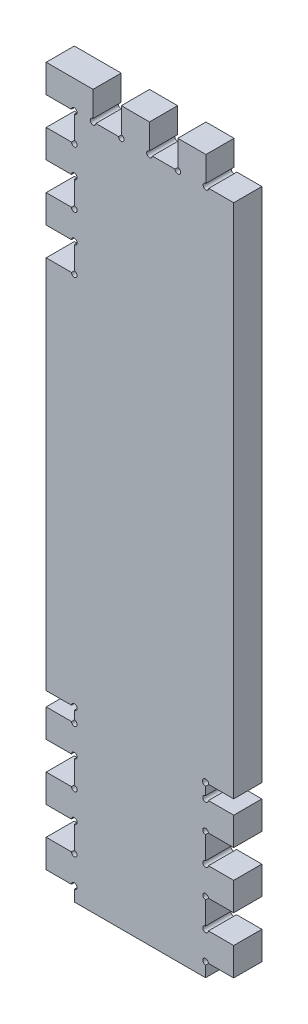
from build123d import *

# Parameters (mm, degrees)
AUFSATZ_LINEAR_AUSTRAGEN1_DEPTH = 15


with BuildPart() as part:
    # Skizze1 → Aufsatz-Linear austragen1 (new body)
    with BuildSketch(Plane.XY):
        with BuildLine():
            Line((0, 82.6), (13.5, 82.6))
            ThreePointArc((13.5, 82.6), (16.060660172, 81.539339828), (15, 84.1))
            Line((15, 84.1), (15, 88.6))
            ThreePointArc((15, 88.6), (16.060660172, 91.160660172), (13.5, 90.1))
            Line((13.5, 90.1), (0, 90.1))
            Line((0, 90.1), (0, 289.970539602))
            Line((0, 289.970539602), (13.5, 289.970539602))
            ThreePointArc((13.5, 289.970539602), (16.060660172, 288.909879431), (15, 291.470539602))
            Line((15, 291.470539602), (15, 303.570539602))
            ThreePointArc((15, 303.570539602), (16.060660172, 306.131199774), (13.5, 305.070539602))
            Line((13.5, 305.070539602), (0, 305.070539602))
            Line((0, 305.070539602), (0, 320.070539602))
            Line((0, 320.070539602), (13.5, 320.070539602))
            ThreePointArc((13.5, 320.070539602), (16.060660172, 319.009879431), (15, 321.570539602))
            Line((15, 321.570539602), (15, 333.670539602))
            ThreePointArc((15, 333.670539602), (16.060660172, 336.231199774), (13.5, 335.170539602))
            Line((13.5, 335.170539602), (0, 335.170539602))
            Line((0, 335.170539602), (0, 350.170539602))
            Line((0, 350.170539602), (13.5, 350.170539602))
            ThreePointArc((13.5, 350.170539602), (16.060660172, 349.109879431), (15, 351.670539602))
            Line((15, 351.670539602), (15, 363.770539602))
            ThreePointArc((15, 363.770539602), (16.060660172, 366.331199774), (13.5, 365.270539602))
            Line((13.5, 365.270539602), (0, 365.270539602))
            Line((0, 365.270539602), (0, 380.270539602))
            Line((0, 380.270539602), (25, 380.270539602))
            Line((25, 380.270539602), (25, 366.770543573))
            ThreePointArc((25, 366.770543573), (23.939339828, 364.209883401), (26.5, 365.270543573))
            Line((26.5, 365.270543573), (38.6, 365.270543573))
            ThreePointArc((38.6, 365.270543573), (41.160660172, 364.209883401), (40.1, 366.770543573))
            Line((40.1, 366.770543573), (40.1, 380.270539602))
            Line((40.1, 380.270539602), (55.1, 380.270539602))
            Line((55.1, 380.270539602), (54.968914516, 366.764800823))
            ThreePointArc((54.968914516, 366.764800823), (54.086744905, 364.16450429), (56.6, 365.270539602))
            Line((56.6, 365.270539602), (68.7, 365.270539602))
            ThreePointArc((68.7, 365.270539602), (71.260660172, 364.209879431), (70.2, 366.770539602))
            Line((70.2, 366.770539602), (70.2, 380.270539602))
            Line((70.2, 380.270539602), (85.2, 380.270539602))
            Line((85.2, 380.270539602), (85.2, 366.9))
            ThreePointArc((85.2, 366.9), (84.139339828, 364.339339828), (86.7, 365.4))
            Line((86.7, 365.4), (100, 365.4))
            Line((100, 365.4), (100, 90.1))
            Line((100, 90.1), (86.7, 90.1))
            ThreePointArc((86.7, 90.1), (83.797918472, 91.302081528), (85, 88.4))
            Line((85, 88.4), (85, 84.1))
            ThreePointArc((85, 84.1), (83.939339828, 81.539339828), (86.5, 82.6))
            Line((86.5, 82.6), (100, 82.6))
            Line((100, 82.6), (100, 67.6))
            Line((100, 67.6), (86.5, 67.6))
            ThreePointArc((86.5, 67.6), (83.939339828, 68.660660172), (85, 66.1))
            Line((85, 66.1), (85, 54))
            ThreePointArc((85, 54), (83.939339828, 51.439339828), (86.5, 52.5))
            Line((86.5, 52.5), (100, 52.5))
            Line((100, 52.5), (100, 37.5))
            Line((100, 37.5), (86.5, 37.5))
            ThreePointArc((86.5, 37.5), (83.939339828, 38.560660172), (85, 36))
            Line((85, 36), (85, 23.9))
            ThreePointArc((85, 23.9), (83.939339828, 21.339339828), (86.5, 22.4))
            Line((86.5, 22.4), (100, 22.4))
            Line((100, 22.4), (100, 7.4))
            Line((100, 7.4), (86.5, 7.4))
            ThreePointArc((86.5, 7.4), (83.939339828, 8.460660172), (85, 5.9))
            Line((85, 5.9), (85, 0))
            Line((85, 0), (15, 0))
            Line((15, 0), (15, 5.9))
            ThreePointArc((15, 5.9), (16.060660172, 8.460660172), (13.5, 7.4))
            Line((13.5, 7.4), (0, 7.4))
            Line((0, 7.4), (0, 22.4))
            Line((0, 22.4), (13.5, 22.4))
            ThreePointArc((13.5, 22.4), (16.060660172, 21.339339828), (15, 23.9))
            Line((15, 23.9), (15, 36))
            ThreePointArc((15, 36), (16.060660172, 38.560660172), (13.5, 37.5))
            Line((13.5, 37.5), (0, 37.5))
            Line((0, 37.5), (0, 52.5))
            Line((0, 52.5), (13.5, 52.5))
            ThreePointArc((13.5, 52.5), (16.060660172, 51.439339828), (15, 54))
            Line((15, 54), (15, 66.1))
            ThreePointArc((15, 66.1), (16.060660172, 68.660660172), (13.5, 67.6))
            Line((13.5, 67.6), (0, 67.6))
            Line((0, 67.6), (0, 82.6))
        make_face()
    extrude(amount=AUFSATZ_LINEAR_AUSTRAGEN1_DEPTH)


solid = part.part
